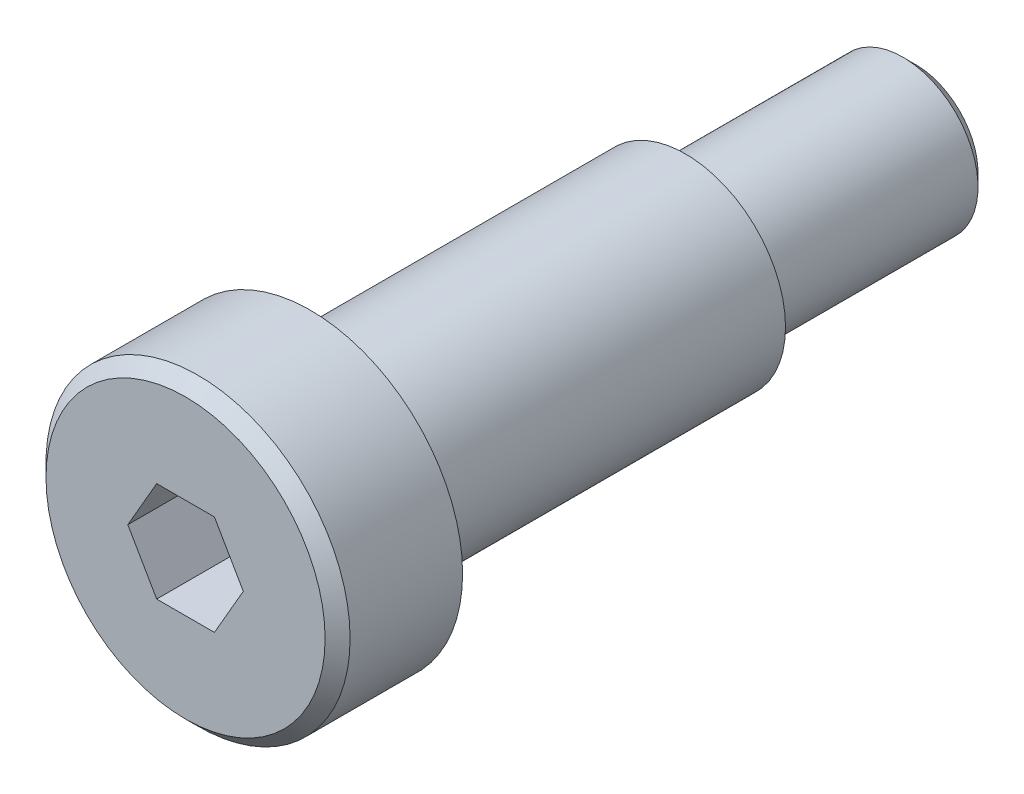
ISO-10303-21;
HEADER;
FILE_DESCRIPTION(('STEP AP214'),'2;1');
FILE_NAME('part.step','',(''),(''),'','','');
FILE_SCHEMA(('AUTOMOTIVE_DESIGN { 1 0 10303 214 1 1 1 1 }'));
ENDSEC;
DATA;
#1=APPLICATION_CONTEXT('core data for automotive mechanical design processes');
#2=APPLICATION_PROTOCOL_DEFINITION('international standard','automotive_design',2000,#1);
#3=PRODUCT_CONTEXT('',#1,'mechanical');
#4=PRODUCT('Part','Part','',(#3));
#5=PRODUCT_RELATED_PRODUCT_CATEGORY('part','',(#4));
#6=PRODUCT_DEFINITION_FORMATION('','',#4);
#7=PRODUCT_DEFINITION_CONTEXT('part definition',#1,'design');
#8=PRODUCT_DEFINITION('design','',#6,#7);
#9=PRODUCT_DEFINITION_SHAPE('','',#8);
#10=(LENGTH_UNIT() NAMED_UNIT(*) SI_UNIT(.MILLI.,.METRE.));
#11=(NAMED_UNIT(*) PLANE_ANGLE_UNIT() SI_UNIT($,.RADIAN.));
#12=(NAMED_UNIT(*) SI_UNIT($,.STERADIAN.) SOLID_ANGLE_UNIT());
#13=UNCERTAINTY_MEASURE_WITH_UNIT(LENGTH_MEASURE(1.E-05),#10,'distance_accuracy_value','');
#14=(GEOMETRIC_REPRESENTATION_CONTEXT(3) GLOBAL_UNCERTAINTY_ASSIGNED_CONTEXT((#13)) GLOBAL_UNIT_ASSIGNED_CONTEXT((#10,
#11,#12)) REPRESENTATION_CONTEXT('',''));
#15=CARTESIAN_POINT('',(0.,0.,0.));
#16=DIRECTION('',(0.,0.,1.));
#17=DIRECTION('',(1.,0.,0.));
#18=AXIS2_PLACEMENT_3D('',#15,#16,#17);
#19=CARTESIAN_POINT('',(0.,0.,10.));
#20=DIRECTION('',(0.,0.,-1.));
#21=DIRECTION('',(-1.,0.,0.));
#22=AXIS2_PLACEMENT_3D('',#19,#20,#21);
#23=CYLINDRICAL_SURFACE('',#22,12.165);
#24=CARTESIAN_POINT('',(0.,0.,8.99999999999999));
#25=DIRECTION('',(0.,0.,1.));
#26=DIRECTION('',(1.,0.,0.));
#27=AXIS2_PLACEMENT_3D('',#24,#25,#26);
#28=CIRCLE('',#27,12.165);
#29=CARTESIAN_POINT('',(12.165,0.,8.99999999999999));
#30=VERTEX_POINT('',#29);
#31=EDGE_CURVE('E11',#30,#30,#28,.F.);
#32=ORIENTED_EDGE('',*,*,#31,.T.);
#33=EDGE_LOOP('',(#32));
#34=FACE_BOUND('',#33,.T.);
#35=CARTESIAN_POINT('',(0.,0.,0.));
#36=DIRECTION('',(0.,0.,1.));
#37=DIRECTION('',(1.,0.,0.));
#38=AXIS2_PLACEMENT_3D('',#35,#36,#37);
#39=CIRCLE('',#38,12.165);
#40=CARTESIAN_POINT('',(12.165,0.,0.));
#41=VERTEX_POINT('',#40);
#42=EDGE_CURVE('E146',#41,#41,#39,.T.);
#43=ORIENTED_EDGE('',*,*,#42,.T.);
#44=EDGE_LOOP('',(#43));
#45=FACE_BOUND('',#44,.T.);
#46=ADVANCED_FACE('F33',(#34,#45),#23,.T.);
#47=CARTESIAN_POINT('',(0.,0.,10.));
#48=DIRECTION('',(0.,0.,1.));
#49=DIRECTION('',(1.,0.,0.));
#50=AXIS2_PLACEMENT_3D('',#47,#48,#49);
#51=PLANE('',#50);
#52=DIRECTION('',(0.5,0.866025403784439,0.));
#53=VECTOR('',#52,1.);
#54=CARTESIAN_POINT('',(2.3094010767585,-4.,10.));
#55=LINE('',#54,#53);
#56=CARTESIAN_POINT('',(2.3094010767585,-4.,10.));
#57=VERTEX_POINT('',#56);
#58=CARTESIAN_POINT('',(4.61880215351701,0.,10.));
#59=VERTEX_POINT('',#58);
#60=EDGE_CURVE('E48',#57,#59,#55,.T.);
#61=ORIENTED_EDGE('',*,*,#60,.F.);
#62=DIRECTION('',(1.,0.,0.));
#63=VECTOR('',#62,1.);
#64=CARTESIAN_POINT('',(-2.3094010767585,-4.,10.));
#65=LINE('',#64,#63);
#66=CARTESIAN_POINT('',(-2.3094010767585,-4.,10.));
#67=VERTEX_POINT('',#66);
#68=EDGE_CURVE('E131',#67,#57,#65,.T.);
#69=ORIENTED_EDGE('',*,*,#68,.F.);
#70=DIRECTION('',(0.5,-0.866025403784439,0.));
#71=VECTOR('',#70,1.);
#72=CARTESIAN_POINT('',(-4.61880215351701,0.,10.));
#73=LINE('',#72,#71);
#74=CARTESIAN_POINT('',(-4.61880215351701,0.,10.));
#75=VERTEX_POINT('',#74);
#76=EDGE_CURVE('E129',#75,#67,#73,.T.);
#77=ORIENTED_EDGE('',*,*,#76,.F.);
#78=DIRECTION('',(-0.5,-0.866025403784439,0.));
#79=VECTOR('',#78,1.);
#80=CARTESIAN_POINT('',(-2.3094010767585,4.,10.));
#81=LINE('',#80,#79);
#82=CARTESIAN_POINT('',(-2.3094010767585,4.,10.));
#83=VERTEX_POINT('',#82);
#84=EDGE_CURVE('E96',#83,#75,#81,.T.);
#85=ORIENTED_EDGE('',*,*,#84,.F.);
#86=DIRECTION('',(-1.,0.,0.));
#87=VECTOR('',#86,1.);
#88=CARTESIAN_POINT('',(2.3094010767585,4.,10.));
#89=LINE('',#88,#87);
#90=CARTESIAN_POINT('',(2.3094010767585,4.,10.));
#91=VERTEX_POINT('',#90);
#92=EDGE_CURVE('E125',#91,#83,#89,.T.);
#93=ORIENTED_EDGE('',*,*,#92,.F.);
#94=DIRECTION('',(-0.5,0.866025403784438,0.));
#95=VECTOR('',#94,1.);
#96=CARTESIAN_POINT('',(4.618802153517,0.,10.));
#97=LINE('',#96,#95);
#98=EDGE_CURVE('E122',#59,#91,#97,.T.);
#99=ORIENTED_EDGE('',*,*,#98,.F.);
#100=EDGE_LOOP('',(#61,#69,#77,#85,#93,#99));
#101=FACE_BOUND('',#100,.T.);
#102=CARTESIAN_POINT('',(0.,0.,10.));
#103=DIRECTION('',(0.,0.,1.));
#104=DIRECTION('',(1.,0.,0.));
#105=AXIS2_PLACEMENT_3D('',#102,#103,#104);
#106=CIRCLE('',#105,11.165);
#107=CARTESIAN_POINT('',(11.165,0.,10.));
#108=VERTEX_POINT('',#107);
#109=EDGE_CURVE('E41',#108,#108,#106,.T.);
#110=ORIENTED_EDGE('',*,*,#109,.T.);
#111=EDGE_LOOP('',(#110));
#112=FACE_BOUND('',#111,.T.);
#113=ADVANCED_FACE('F160',(#101,#112),#51,.T.);
#114=CARTESIAN_POINT('',(0.,0.,0.));
#115=DIRECTION('',(0.,0.,1.));
#116=DIRECTION('',(1.,0.,0.));
#117=AXIS2_PLACEMENT_3D('',#114,#115,#116);
#118=PLANE('',#117);
#119=CARTESIAN_POINT('',(0.,0.,0.));
#120=DIRECTION('',(0.,0.,1.));
#121=DIRECTION('',(1.,0.,0.));
#122=AXIS2_PLACEMENT_3D('',#119,#120,#121);
#123=CIRCLE('',#122,8.);
#124=CARTESIAN_POINT('',(8.,0.,0.));
#125=VERTEX_POINT('',#124);
#126=EDGE_CURVE('E149',#125,#125,#123,.F.);
#127=ORIENTED_EDGE('',*,*,#126,.F.);
#128=EDGE_LOOP('',(#127));
#129=FACE_BOUND('',#128,.T.);
#130=ORIENTED_EDGE('',*,*,#42,.F.);
#131=EDGE_LOOP('',(#130));
#132=FACE_BOUND('',#131,.T.);
#133=ADVANCED_FACE('F181',(#129,#132),#118,.F.);
#134=CARTESIAN_POINT('',(0.,0.,-30.));
#135=DIRECTION('',(0.,0.,1.));
#136=DIRECTION('',(1.,0.,0.));
#137=AXIS2_PLACEMENT_3D('',#134,#135,#136);
#138=CYLINDRICAL_SURFACE('',#137,8.);
#139=CARTESIAN_POINT('',(0.,0.,-30.));
#140=DIRECTION('',(0.,0.,-1.));
#141=DIRECTION('',(-1.,0.,0.));
#142=AXIS2_PLACEMENT_3D('',#139,#140,#141);
#143=CIRCLE('',#142,8.);
#144=CARTESIAN_POINT('',(-8.,0.,-30.));
#145=VERTEX_POINT('',#144);
#146=EDGE_CURVE('E143',#145,#145,#143,.T.);
#147=ORIENTED_EDGE('',*,*,#146,.F.);
#148=EDGE_LOOP('',(#147));
#149=FACE_BOUND('',#148,.T.);
#150=ORIENTED_EDGE('',*,*,#126,.T.);
#151=EDGE_LOOP('',(#150));
#152=FACE_BOUND('',#151,.T.);
#153=ADVANCED_FACE('F187',(#149,#152),#138,.T.);
#154=CARTESIAN_POINT('',(0.,0.,-30.));
#155=DIRECTION('',(0.,0.,-1.));
#156=DIRECTION('',(-1.,0.,0.));
#157=AXIS2_PLACEMENT_3D('',#154,#155,#156);
#158=PLANE('',#157);
#159=CARTESIAN_POINT('',(0.,0.,-30.));
#160=DIRECTION('',(0.,0.,-1.));
#161=DIRECTION('',(-1.,0.,0.));
#162=AXIS2_PLACEMENT_3D('',#159,#160,#161);
#163=CIRCLE('',#162,6.);
#164=CARTESIAN_POINT('',(-6.,0.,-30.));
#165=VERTEX_POINT('',#164);
#166=EDGE_CURVE('E135',#165,#165,#163,.T.);
#167=ORIENTED_EDGE('',*,*,#166,.F.);
#168=EDGE_LOOP('',(#167));
#169=FACE_BOUND('',#168,.T.);
#170=ORIENTED_EDGE('',*,*,#146,.T.);
#171=EDGE_LOOP('',(#170));
#172=FACE_BOUND('',#171,.T.);
#173=ADVANCED_FACE('F192',(#169,#172),#158,.T.);
#174=CARTESIAN_POINT('',(0.,0.,-48.4));
#175=DIRECTION('',(0.,0.,1.));
#176=DIRECTION('',(1.,0.,0.));
#177=AXIS2_PLACEMENT_3D('',#174,#175,#176);
#178=CYLINDRICAL_SURFACE('',#177,6.);
#179=CARTESIAN_POINT('',(0.,0.,-47.4));
#180=DIRECTION('',(0.,0.,-1.));
#181=DIRECTION('',(-1.,0.,0.));
#182=AXIS2_PLACEMENT_3D('',#179,#180,#181);
#183=CIRCLE('',#182,6.);
#184=CARTESIAN_POINT('',(-6.,0.,-47.4));
#185=VERTEX_POINT('',#184);
#186=EDGE_CURVE('E155',#185,#185,#183,.F.);
#187=ORIENTED_EDGE('',*,*,#186,.T.);
#188=EDGE_LOOP('',(#187));
#189=FACE_BOUND('',#188,.T.);
#190=ORIENTED_EDGE('',*,*,#166,.T.);
#191=EDGE_LOOP('',(#190));
#192=FACE_BOUND('',#191,.T.);
#193=ADVANCED_FACE('F196',(#189,#192),#178,.T.);
#194=CARTESIAN_POINT('',(0.,0.,-48.4));
#195=DIRECTION('',(0.,0.,-1.));
#196=DIRECTION('',(-1.,0.,0.));
#197=AXIS2_PLACEMENT_3D('',#194,#195,#196);
#198=PLANE('',#197);
#199=CARTESIAN_POINT('',(0.,0.,-48.4));
#200=DIRECTION('',(0.,0.,-1.));
#201=DIRECTION('',(-1.,0.,0.));
#202=AXIS2_PLACEMENT_3D('',#199,#200,#201);
#203=CIRCLE('',#202,5.);
#204=CARTESIAN_POINT('',(-5.,0.,-48.4));
#205=VERTEX_POINT('',#204);
#206=EDGE_CURVE('E152',#205,#205,#203,.T.);
#207=ORIENTED_EDGE('',*,*,#206,.T.);
#208=EDGE_LOOP('',(#207));
#209=FACE_BOUND('',#208,.T.);
#210=ADVANCED_FACE('F172',(#209),#198,.T.);
#211=CARTESIAN_POINT('',(0.,0.,-48.4));
#212=DIRECTION('',(0.,0.,1.));
#213=DIRECTION('',(1.,0.,0.));
#214=AXIS2_PLACEMENT_3D('',#211,#212,#213);
#215=CONICAL_SURFACE('',#214,5.,0.785398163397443);
#216=ORIENTED_EDGE('',*,*,#186,.F.);
#217=EDGE_LOOP('',(#216));
#218=FACE_BOUND('',#217,.T.);
#219=ORIENTED_EDGE('',*,*,#206,.F.);
#220=EDGE_LOOP('',(#219));
#221=FACE_BOUND('',#220,.T.);
#222=ADVANCED_FACE('F164',(#218,#221),#215,.T.);
#223=CARTESIAN_POINT('',(0.,0.,10.));
#224=DIRECTION('',(0.,0.,-1.));
#225=DIRECTION('',(-1.,0.,0.));
#226=AXIS2_PLACEMENT_3D('',#223,#224,#225);
#227=CONICAL_SURFACE('',#226,11.165,0.785398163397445);
#228=ORIENTED_EDGE('',*,*,#31,.F.);
#229=EDGE_LOOP('',(#228));
#230=FACE_BOUND('',#229,.T.);
#231=ORIENTED_EDGE('',*,*,#109,.F.);
#232=EDGE_LOOP('',(#231));
#233=FACE_BOUND('',#232,.T.);
#234=ADVANCED_FACE('F35',(#230,#233),#227,.T.);
#235=CARTESIAN_POINT('',(2.3094010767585,-4.,3.4));
#236=DIRECTION('',(0.866025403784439,-0.5,0.));
#237=DIRECTION('',(0.5,0.866025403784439,0.));
#238=AXIS2_PLACEMENT_3D('',#235,#236,#237);
#239=PLANE('',#238);
#240=ORIENTED_EDGE('',*,*,#60,.T.);
#241=DIRECTION('',(0.,0.,1.));
#242=VECTOR('',#241,1.);
#243=CARTESIAN_POINT('',(4.618802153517,0.,3.4));
#244=LINE('',#243,#242);
#245=CARTESIAN_POINT('',(4.618802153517,0.,3.4));
#246=VERTEX_POINT('',#245);
#247=EDGE_CURVE('E78',#246,#59,#244,.T.);
#248=ORIENTED_EDGE('',*,*,#247,.F.);
#249=DIRECTION('',(0.5,0.866025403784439,0.));
#250=VECTOR('',#249,1.);
#251=CARTESIAN_POINT('',(2.3094010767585,-4.,3.4));
#252=LINE('',#251,#250);
#253=CARTESIAN_POINT('',(2.3094010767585,-4.,3.4));
#254=VERTEX_POINT('',#253);
#255=EDGE_CURVE('E133',#254,#246,#252,.T.);
#256=ORIENTED_EDGE('',*,*,#255,.F.);
#257=DIRECTION('',(0.,0.,1.));
#258=VECTOR('',#257,1.);
#259=CARTESIAN_POINT('',(2.3094010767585,-4.,3.4));
#260=LINE('',#259,#258);
#261=EDGE_CURVE('E56',#254,#57,#260,.T.);
#262=ORIENTED_EDGE('',*,*,#261,.T.);
#263=EDGE_LOOP('',(#240,#248,#256,#262));
#264=FACE_BOUND('',#263,.T.);
#265=ADVANCED_FACE('F163',(#264),#239,.F.);
#266=CARTESIAN_POINT('',(-2.3094010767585,-4.,3.4));
#267=DIRECTION('',(0.,-1.,0.));
#268=DIRECTION('',(1.,0.,0.));
#269=AXIS2_PLACEMENT_3D('',#266,#267,#268);
#270=PLANE('',#269);
#271=ORIENTED_EDGE('',*,*,#68,.T.);
#272=ORIENTED_EDGE('',*,*,#261,.F.);
#273=DIRECTION('',(1.,0.,0.));
#274=VECTOR('',#273,1.);
#275=CARTESIAN_POINT('',(-2.3094010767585,-4.,3.4));
#276=LINE('',#275,#274);
#277=CARTESIAN_POINT('',(-2.3094010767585,-4.,3.4));
#278=VERTEX_POINT('',#277);
#279=EDGE_CURVE('E108',#278,#254,#276,.T.);
#280=ORIENTED_EDGE('',*,*,#279,.F.);
#281=DIRECTION('',(0.,0.,1.));
#282=VECTOR('',#281,1.);
#283=CARTESIAN_POINT('',(-2.3094010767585,-4.,3.4));
#284=LINE('',#283,#282);
#285=EDGE_CURVE('E100',#278,#67,#284,.T.);
#286=ORIENTED_EDGE('',*,*,#285,.T.);
#287=EDGE_LOOP('',(#271,#272,#280,#286));
#288=FACE_BOUND('',#287,.T.);
#289=ADVANCED_FACE('F170',(#288),#270,.F.);
#290=CARTESIAN_POINT('',(-4.61880215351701,0.,3.4));
#291=DIRECTION('',(-0.866025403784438,-0.5,0.));
#292=DIRECTION('',(0.5,-0.866025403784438,0.));
#293=AXIS2_PLACEMENT_3D('',#290,#291,#292);
#294=PLANE('',#293);
#295=ORIENTED_EDGE('',*,*,#76,.T.);
#296=ORIENTED_EDGE('',*,*,#285,.F.);
#297=DIRECTION('',(0.5,-0.866025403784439,0.));
#298=VECTOR('',#297,1.);
#299=CARTESIAN_POINT('',(-4.61880215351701,0.,3.4));
#300=LINE('',#299,#298);
#301=CARTESIAN_POINT('',(-4.61880215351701,0.,3.4));
#302=VERTEX_POINT('',#301);
#303=EDGE_CURVE('E104',#302,#278,#300,.T.);
#304=ORIENTED_EDGE('',*,*,#303,.F.);
#305=DIRECTION('',(0.,0.,1.));
#306=VECTOR('',#305,1.);
#307=CARTESIAN_POINT('',(-4.61880215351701,0.,3.4));
#308=LINE('',#307,#306);
#309=EDGE_CURVE('E89',#302,#75,#308,.T.);
#310=ORIENTED_EDGE('',*,*,#309,.T.);
#311=EDGE_LOOP('',(#295,#296,#304,#310));
#312=FACE_BOUND('',#311,.T.);
#313=ADVANCED_FACE('F105',(#312),#294,.F.);
#314=CARTESIAN_POINT('',(-2.3094010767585,4.,3.4));
#315=DIRECTION('',(-0.866025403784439,0.5,0.));
#316=DIRECTION('',(-0.5,-0.866025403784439,0.));
#317=AXIS2_PLACEMENT_3D('',#314,#315,#316);
#318=PLANE('',#317);
#319=ORIENTED_EDGE('',*,*,#84,.T.);
#320=ORIENTED_EDGE('',*,*,#309,.F.);
#321=DIRECTION('',(-0.5,-0.866025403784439,0.));
#322=VECTOR('',#321,1.);
#323=CARTESIAN_POINT('',(-2.3094010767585,4.,3.4));
#324=LINE('',#323,#322);
#325=CARTESIAN_POINT('',(-2.3094010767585,4.,3.4));
#326=VERTEX_POINT('',#325);
#327=EDGE_CURVE('E93',#326,#302,#324,.T.);
#328=ORIENTED_EDGE('',*,*,#327,.F.);
#329=DIRECTION('',(0.,0.,1.));
#330=VECTOR('',#329,1.);
#331=CARTESIAN_POINT('',(-2.3094010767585,4.,3.4));
#332=LINE('',#331,#330);
#333=EDGE_CURVE('E101',#326,#83,#332,.T.);
#334=ORIENTED_EDGE('',*,*,#333,.T.);
#335=EDGE_LOOP('',(#319,#320,#328,#334));
#336=FACE_BOUND('',#335,.T.);
#337=ADVANCED_FACE('F91',(#336),#318,.F.);
#338=CARTESIAN_POINT('',(2.3094010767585,4.,3.4));
#339=DIRECTION('',(0.,1.,0.));
#340=DIRECTION('',(0.,0.,1.));
#341=AXIS2_PLACEMENT_3D('',#338,#339,#340);
#342=PLANE('',#341);
#343=ORIENTED_EDGE('',*,*,#92,.T.);
#344=ORIENTED_EDGE('',*,*,#333,.F.);
#345=DIRECTION('',(-1.,0.,0.));
#346=VECTOR('',#345,1.);
#347=CARTESIAN_POINT('',(2.3094010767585,4.,3.4));
#348=LINE('',#347,#346);
#349=CARTESIAN_POINT('',(2.3094010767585,4.,3.4));
#350=VERTEX_POINT('',#349);
#351=EDGE_CURVE('E114',#350,#326,#348,.T.);
#352=ORIENTED_EDGE('',*,*,#351,.F.);
#353=DIRECTION('',(0.,0.,1.));
#354=VECTOR('',#353,1.);
#355=CARTESIAN_POINT('',(2.3094010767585,4.,3.4));
#356=LINE('',#355,#354);
#357=EDGE_CURVE('E138',#350,#91,#356,.T.);
#358=ORIENTED_EDGE('',*,*,#357,.T.);
#359=EDGE_LOOP('',(#343,#344,#352,#358));
#360=FACE_BOUND('',#359,.T.);
#361=ADVANCED_FACE('F207',(#360),#342,.F.);
#362=CARTESIAN_POINT('',(4.618802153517,0.,3.4));
#363=DIRECTION('',(0.866025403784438,0.5,0.));
#364=DIRECTION('',(-0.5,0.866025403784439,0.));
#365=AXIS2_PLACEMENT_3D('',#362,#363,#364);
#366=PLANE('',#365);
#367=ORIENTED_EDGE('',*,*,#98,.T.);
#368=ORIENTED_EDGE('',*,*,#357,.F.);
#369=DIRECTION('',(-0.5,0.866025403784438,0.));
#370=VECTOR('',#369,1.);
#371=CARTESIAN_POINT('',(4.618802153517,0.,3.4));
#372=LINE('',#371,#370);
#373=EDGE_CURVE('E116',#246,#350,#372,.T.);
#374=ORIENTED_EDGE('',*,*,#373,.F.);
#375=ORIENTED_EDGE('',*,*,#247,.T.);
#376=EDGE_LOOP('',(#367,#368,#374,#375));
#377=FACE_BOUND('',#376,.T.);
#378=ADVANCED_FACE('F204',(#377),#366,.F.);
#379=CARTESIAN_POINT('',(0.,0.,3.4));
#380=DIRECTION('',(0.,0.,1.));
#381=DIRECTION('',(1.,0.,0.));
#382=AXIS2_PLACEMENT_3D('',#379,#380,#381);
#383=PLANE('',#382);
#384=ORIENTED_EDGE('',*,*,#255,.T.);
#385=ORIENTED_EDGE('',*,*,#373,.T.);
#386=ORIENTED_EDGE('',*,*,#351,.T.);
#387=ORIENTED_EDGE('',*,*,#327,.T.);
#388=ORIENTED_EDGE('',*,*,#303,.T.);
#389=ORIENTED_EDGE('',*,*,#279,.T.);
#390=EDGE_LOOP('',(#384,#385,#386,#387,#388,#389));
#391=FACE_BOUND('',#390,.T.);
#392=ADVANCED_FACE('F111',(#391),#383,.T.);
#393=CLOSED_SHELL('',(#46,#113,#133,#153,#173,#193,#210,#222,#234,#265,#289,#313,#337,#361,#378,#392));
#394=MANIFOLD_SOLID_BREP('B2',#393);
#395=ADVANCED_BREP_SHAPE_REPRESENTATION('',(#18,#394),#14);
#396=SHAPE_DEFINITION_REPRESENTATION(#9,#395);
ENDSEC;
END-ISO-10303-21;
